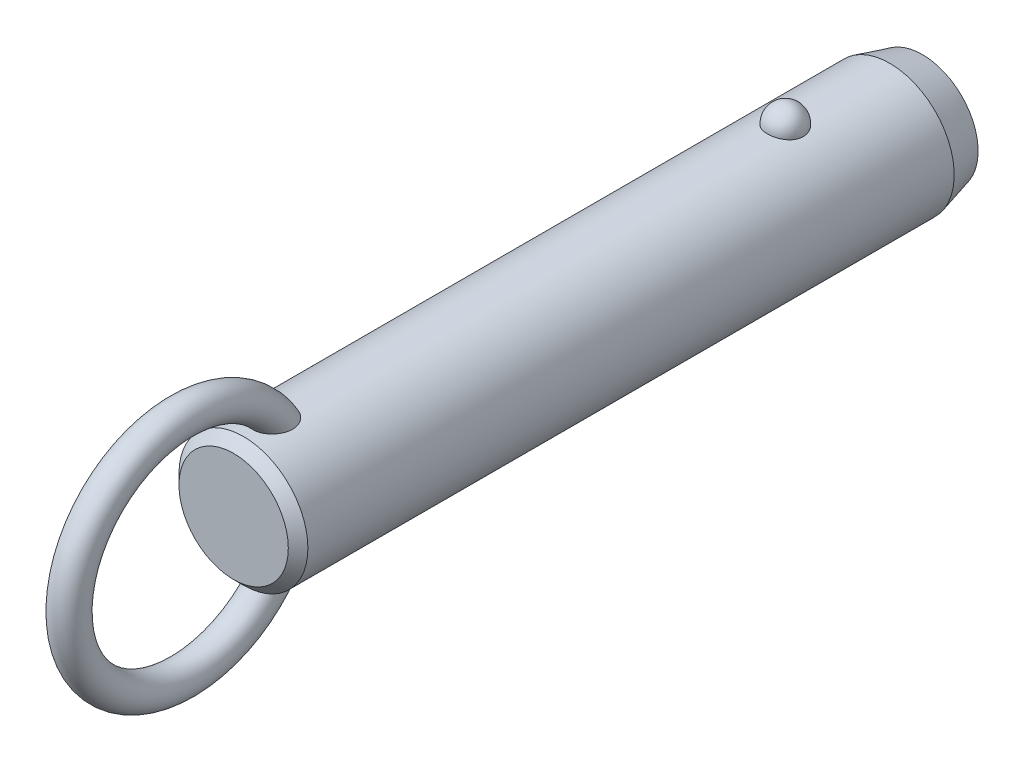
ISO-10303-21;
HEADER;
FILE_DESCRIPTION(('STEP AP214'),'2;1');
FILE_NAME('part.step','',(''),(''),'','','');
FILE_SCHEMA(('AUTOMOTIVE_DESIGN { 1 0 10303 214 1 1 1 1 }'));
ENDSEC;
DATA;
#1=APPLICATION_CONTEXT('core data for automotive mechanical design processes');
#2=APPLICATION_PROTOCOL_DEFINITION('international standard','automotive_design',2000,#1);
#3=PRODUCT_CONTEXT('',#1,'mechanical');
#4=PRODUCT('Part','Part','',(#3));
#5=PRODUCT_RELATED_PRODUCT_CATEGORY('part','',(#4));
#6=PRODUCT_DEFINITION_FORMATION('','',#4);
#7=PRODUCT_DEFINITION_CONTEXT('part definition',#1,'design');
#8=PRODUCT_DEFINITION('design','',#6,#7);
#9=PRODUCT_DEFINITION_SHAPE('','',#8);
#10=(LENGTH_UNIT() NAMED_UNIT(*) SI_UNIT(.MILLI.,.METRE.));
#11=(NAMED_UNIT(*) PLANE_ANGLE_UNIT() SI_UNIT($,.RADIAN.));
#12=(NAMED_UNIT(*) SI_UNIT($,.STERADIAN.) SOLID_ANGLE_UNIT());
#13=UNCERTAINTY_MEASURE_WITH_UNIT(LENGTH_MEASURE(1.E-05),#10,'distance_accuracy_value','');
#14=(GEOMETRIC_REPRESENTATION_CONTEXT(3) GLOBAL_UNCERTAINTY_ASSIGNED_CONTEXT((#13)) GLOBAL_UNIT_ASSIGNED_CONTEXT((#10,
#11,#12)) REPRESENTATION_CONTEXT('',''));
#15=CARTESIAN_POINT('',(0.,0.,0.));
#16=DIRECTION('',(0.,0.,1.));
#17=DIRECTION('',(1.,0.,0.));
#18=AXIS2_PLACEMENT_3D('',#15,#16,#17);
#19=CARTESIAN_POINT('',(0.,0.,55.9));
#20=DIRECTION('',(0.,0.,-1.));
#21=DIRECTION('',(-1.,0.,0.));
#22=AXIS2_PLACEMENT_3D('',#19,#20,#21);
#23=CYLINDRICAL_SURFACE('',#22,7.9);
#24=CARTESIAN_POINT('',(2.1785689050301,7.59367088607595,-2.2));
#25=CARTESIAN_POINT('',(2.17856679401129,7.59367269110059,-2.07701843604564));
#26=CARTESIAN_POINT('',(2.16853481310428,7.59657145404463,-1.95401006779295));
#27=CARTESIAN_POINT('',(2.12864689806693,7.607843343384,-1.71147811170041));
#28=CARTESIAN_POINT('',(2.09878338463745,7.61621856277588,-1.59195587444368));
#29=CARTESIAN_POINT('',(2.0199931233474,7.63749180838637,-1.35985638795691));
#30=CARTESIAN_POINT('',(1.97107475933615,7.6503878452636,-1.24727610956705));
#31=CARTESIAN_POINT('',(1.85539377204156,7.67926115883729,-1.03213234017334));
#32=CARTESIAN_POINT('',(1.78863158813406,7.69523835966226,-0.9295686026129));
#33=CARTESIAN_POINT('',(1.63856494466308,7.7285848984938,-0.736786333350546));
#34=CARTESIAN_POINT('',(1.55518140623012,7.7459606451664,-0.646630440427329));
#35=CARTESIAN_POINT('',(1.37422937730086,7.78009978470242,-0.481747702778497));
#36=CARTESIAN_POINT('',(1.27666086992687,7.79686317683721,-0.4070208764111));
#37=CARTESIAN_POINT('',(1.07024728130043,7.82786153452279,-0.275278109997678));
#38=CARTESIAN_POINT('',(0.961434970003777,7.84210353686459,-0.218212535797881));
#39=CARTESIAN_POINT('',(0.735351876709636,7.86652194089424,-0.123146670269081));
#40=CARTESIAN_POINT('',(0.618082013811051,7.87669878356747,-0.0851443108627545));
#41=CARTESIAN_POINT('',(0.380637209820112,7.89170521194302,-0.0298158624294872));
#42=CARTESIAN_POINT('',(0.260550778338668,7.89662650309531,-0.0121347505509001));
#43=CARTESIAN_POINT('',(0.0190117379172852,7.90090003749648,0.00324379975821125));
#44=CARTESIAN_POINT('',(-0.102440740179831,7.90025280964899,0.000943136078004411));
#45=CARTESIAN_POINT('',(-0.341452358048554,7.89351056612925,-0.0233955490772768));
#46=CARTESIAN_POINT('',(-0.459042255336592,7.88749257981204,-0.0451545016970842));
#47=CARTESIAN_POINT('',(-0.688796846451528,7.87075812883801,-0.107408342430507));
#48=CARTESIAN_POINT('',(-0.800961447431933,7.86004158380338,-0.147903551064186));
#49=CARTESIAN_POINT('',(-1.01743634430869,7.83497131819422,-0.246799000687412));
#50=CARTESIAN_POINT('',(-1.12169791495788,7.82059709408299,-0.305300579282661));
#51=CARTESIAN_POINT('',(-1.31891765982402,7.78976470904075,-0.438549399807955));
#52=CARTESIAN_POINT('',(-1.41187469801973,7.77330633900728,-0.513298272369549));
#53=CARTESIAN_POINT('',(-1.58577142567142,7.73972434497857,-0.678622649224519));
#54=CARTESIAN_POINT('',(-1.66645140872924,7.72259402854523,-0.769470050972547));
#55=CARTESIAN_POINT('',(-1.81161503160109,7.68983776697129,-0.963538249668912));
#56=CARTESIAN_POINT('',(-1.87609753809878,7.6742119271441,-1.06675991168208));
#57=CARTESIAN_POINT('',(-1.98790138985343,7.6460202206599,-1.28401170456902));
#58=CARTESIAN_POINT('',(-2.03501994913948,7.63349104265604,-1.39815107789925));
#59=CARTESIAN_POINT('',(-2.10986724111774,7.6131449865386,-1.63301784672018));
#60=CARTESIAN_POINT('',(-2.1375965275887,7.60532797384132,-1.75374505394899));
#61=CARTESIAN_POINT('',(-2.17289256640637,7.5953195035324,-1.99782562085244));
#62=CARTESIAN_POINT('',(-2.18054294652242,7.59310471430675,-2.12116592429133));
#63=CARTESIAN_POINT('',(-2.17572919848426,7.59448538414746,-2.36741799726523));
#64=CARTESIAN_POINT('',(-2.1632656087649,7.59808068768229,-2.49032977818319));
#65=CARTESIAN_POINT('',(-2.11865035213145,7.61064035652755,-2.73161015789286));
#66=CARTESIAN_POINT('',(-2.08659579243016,7.61957823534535,-2.84999812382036));
#67=CARTESIAN_POINT('',(-2.00367799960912,7.64179982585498,-3.07955956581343));
#68=CARTESIAN_POINT('',(-1.9528140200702,7.65508371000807,-3.19073275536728));
#69=CARTESIAN_POINT('',(-1.83321113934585,7.68460381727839,-3.40337899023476));
#70=CARTESIAN_POINT('',(-1.76437735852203,7.70085556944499,-3.50479651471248));
#71=CARTESIAN_POINT('',(-1.61069526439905,7.73445734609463,-3.69446912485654));
#72=CARTESIAN_POINT('',(-1.52584634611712,7.75180741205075,-3.78272371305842));
#73=CARTESIAN_POINT('',(-1.34198059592,7.78574608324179,-3.94393987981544));
#74=CARTESIAN_POINT('',(-1.24291308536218,7.80233167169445,-4.01684434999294));
#75=CARTESIAN_POINT('',(-1.03352039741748,7.83281625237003,-4.14489386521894));
#76=CARTESIAN_POINT('',(-0.92319600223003,7.84671543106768,-4.20004014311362));
#77=CARTESIAN_POINT('',(-0.695822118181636,7.87011575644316,-4.29042017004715));
#78=CARTESIAN_POINT('',(-0.578872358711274,7.87966903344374,-4.32589112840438));
#79=CARTESIAN_POINT('',(-0.340410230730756,7.8935652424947,-4.37692226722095));
#80=CARTESIAN_POINT('',(-0.218898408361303,7.89790879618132,-4.39248482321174));
#81=CARTESIAN_POINT('',(0.0228107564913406,7.90087453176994,-4.40314405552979));
#82=CARTESIAN_POINT('',(0.142990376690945,7.89960185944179,-4.39861683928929));
#83=CARTESIAN_POINT('',(0.380829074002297,7.89171262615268,-4.37008293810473));
#84=CARTESIAN_POINT('',(0.498488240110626,7.8850962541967,-4.34607694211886));
#85=CARTESIAN_POINT('',(0.727535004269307,7.86726442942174,-4.27939317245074));
#86=CARTESIAN_POINT('',(0.838944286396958,7.85606616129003,-4.23678512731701));
#87=CARTESIAN_POINT('',(1.05295421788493,7.83025654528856,-4.13408348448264));
#88=CARTESIAN_POINT('',(1.15555431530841,7.81564498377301,-4.07398879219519));
#89=CARTESIAN_POINT('',(1.35076763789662,7.7843022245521,-3.93687432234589));
#90=CARTESIAN_POINT('',(1.4432046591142,7.76754209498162,-3.85961036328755));
#91=CARTESIAN_POINT('',(1.6139111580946,7.73387857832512,-3.69076949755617));
#92=CARTESIAN_POINT('',(1.6921781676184,7.71697516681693,-3.59919010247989));
#93=CARTESIAN_POINT('',(1.83380875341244,7.6845643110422,-3.40247278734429));
#94=CARTESIAN_POINT('',(1.89689280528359,7.66908588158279,-3.29712873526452));
#95=CARTESIAN_POINT('',(2.0047823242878,7.64159441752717,-3.07707931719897));
#96=CARTESIAN_POINT('',(2.0495945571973,7.62958010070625,-2.96237743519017));
#97=CARTESIAN_POINT('',(2.11580183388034,7.61146617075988,-2.74040519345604));
#98=CARTESIAN_POINT('',(2.13929812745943,7.60484503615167,-2.63379846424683));
#99=CARTESIAN_POINT('',(2.17068242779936,7.59594664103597,-2.41813481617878));
#100=CARTESIAN_POINT('',(2.17857077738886,7.59366928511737,-2.30907795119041));
#101=CARTESIAN_POINT('',(2.1785689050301,7.59367088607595,-2.2));
#102=B_SPLINE_CURVE_WITH_KNOTS('',3,(#24,#25,#26,#27,#28,#29,#30,#31,#32,#33,#34,#35,#36,#37,
#38,#39,#40,#41,#42,#43,#44,#45,#46,#47,#48,#49,#50,#51,#52,#53,#54,#55,#56,#57,#58,#59,#60,#61,
#62,#63,#64,#65,#66,#67,#68,#69,#70,#71,#72,#73,#74,#75,#76,#77,#78,#79,#80,#81,#82,#83,#84,#85,
#86,#87,#88,#89,#90,#91,#92,#93,#94,#95,#96,#97,#98,#99,#100,#101),.UNSPECIFIED.,.T.,.F.,(4,2,2,
2,2,2,2,2,2,2,2,2,2,2,2,2,2,2,2,2,2,2,2,2,2,2,2,2,2,2,2,2,2,2,2,2,2,2,4),(0.,0.368552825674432,
0.737246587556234,1.10577831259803,1.4743009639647,1.8446206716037,2.21494081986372,
2.5842105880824,2.95344028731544,3.31611630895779,3.67875788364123,4.03628044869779,
4.39380913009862,4.75338791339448,5.11300280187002,5.47939989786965,5.8458226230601,
6.21639834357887,6.58696347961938,6.95598276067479,7.32499216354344,7.69218715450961,
8.0593967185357,8.42858578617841,8.79778880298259,9.16834203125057,9.5388695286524,
9.90482699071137,10.2707407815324,10.6298333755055,10.9889132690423,11.3466585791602,
11.7044262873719,12.0676511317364,12.4309391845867,12.8004764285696,13.1698767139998,
13.4967701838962,13.8236564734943),.UNSPECIFIED.);
#103=CARTESIAN_POINT('',(2.1785689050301,7.59367088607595,-2.2));
#104=VERTEX_POINT('',#103);
#105=EDGE_CURVE('E41',#104,#104,#102,.T.);
#106=ORIENTED_EDGE('',*,*,#105,.T.);
#107=EDGE_LOOP('',(#106));
#108=FACE_BOUND('',#107,.T.);
#109=CARTESIAN_POINT('',(0.,0.,64.22));
#110=DIRECTION('',(0.,0.,1.));
#111=DIRECTION('',(1.,0.,0.));
#112=AXIS2_PLACEMENT_3D('',#109,#110,#111);
#113=CIRCLE('',#112,7.9);
#114=CARTESIAN_POINT('',(7.9,0.,64.22));
#115=VERTEX_POINT('',#114);
#116=EDGE_CURVE('E10',#115,#115,#113,.F.);
#117=ORIENTED_EDGE('',*,*,#116,.T.);
#118=EDGE_LOOP('',(#117));
#119=FACE_BOUND('',#118,.T.);
#120=CARTESIAN_POINT('',(-0.63096985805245,-7.87476203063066,58.1124322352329));
#121=CARTESIAN_POINT('',(-0.734180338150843,-7.86648998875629,58.147285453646));
#122=CARTESIAN_POINT('',(-0.834476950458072,-7.85639291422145,58.1908160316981));
#123=CARTESIAN_POINT('',(-1.0262035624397,-7.83366343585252,58.294094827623));
#124=CARTESIAN_POINT('',(-1.1176141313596,-7.82102565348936,58.3538775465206));
#125=CARTESIAN_POINT('',(-1.28877277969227,-7.79464922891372,58.4878390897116));
#126=CARTESIAN_POINT('',(-1.36854014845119,-7.78091246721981,58.561993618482));
#127=CARTESIAN_POINT('',(-1.51461521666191,-7.75380398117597,58.7224941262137));
#128=CARTESIAN_POINT('',(-1.58092966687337,-7.74043207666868,58.8088339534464));
#129=CARTESIAN_POINT('',(-1.70019064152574,-7.71512522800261,58.9929784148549));
#130=CARTESIAN_POINT('',(-1.75284037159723,-7.70322473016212,59.0909792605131));
#131=CARTESIAN_POINT('',(-1.84263464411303,-7.68224112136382,59.2941029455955));
#132=CARTESIAN_POINT('',(-1.87977299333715,-7.6731591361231,59.3992286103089));
#133=CARTESIAN_POINT('',(-1.94152728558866,-7.65777930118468,59.6232849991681));
#134=CARTESIAN_POINT('',(-1.96475471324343,-7.65179654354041,59.7426167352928));
#135=CARTESIAN_POINT('',(-1.99449499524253,-7.64409642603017,59.9834298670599));
#136=CARTESIAN_POINT('',(-2.0010005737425,-7.64238092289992,60.1049121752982));
#137=CARTESIAN_POINT('',(-1.99856014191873,-7.64302120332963,60.3683409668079));
#138=CARTESIAN_POINT('',(-1.98680021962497,-7.64611845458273,60.5102565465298));
#139=CARTESIAN_POINT('',(-1.94457772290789,-7.65696186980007,60.7911188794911));
#140=CARTESIAN_POINT('',(-1.91409393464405,-7.66471330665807,60.9300620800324));
#141=CARTESIAN_POINT('',(-1.82768670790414,-7.68582947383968,61.231939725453));
#142=CARTESIAN_POINT('',(-1.76772963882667,-7.70003779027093,61.393686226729));
#143=CARTESIAN_POINT('',(-1.65998501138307,-7.72371550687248,61.6276956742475));
#144=CARTESIAN_POINT('',(-1.621079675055,-7.73200670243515,61.7042974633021));
#145=CARTESIAN_POINT('',(-1.53727726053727,-7.74910377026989,61.8540798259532));
#146=CARTESIAN_POINT('',(-1.49238215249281,-7.75790947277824,61.9272615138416));
#147=CARTESIAN_POINT('',(-1.37397050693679,-7.77993338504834,62.1028838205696));
#148=CARTESIAN_POINT('',(-1.29690364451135,-7.79328473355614,62.2029557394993));
#149=CARTESIAN_POINT('',(-1.12885487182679,-7.81939266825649,62.3907147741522));
#150=CARTESIAN_POINT('',(-1.03789926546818,-7.83215032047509,62.4784247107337));
#151=CARTESIAN_POINT('',(-0.869532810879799,-7.85231710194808,62.6134148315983));
#152=CARTESIAN_POINT('',(-0.795716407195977,-7.86021093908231,62.665076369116));
#153=CARTESIAN_POINT('',(-0.640813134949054,-7.87434920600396,62.7563815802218));
#154=CARTESIAN_POINT('',(-0.559737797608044,-7.88059619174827,62.7960438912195));
#155=CARTESIAN_POINT('',(-0.406456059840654,-7.88984116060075,62.8543008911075));
#156=CARTESIAN_POINT('',(-0.335227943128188,-7.89321892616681,62.8753848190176));
#157=CARTESIAN_POINT('',(-0.190193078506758,-7.89804235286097,62.9054141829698));
#158=CARTESIAN_POINT('',(-0.116388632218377,-7.89948969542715,62.9143701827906));
#159=CARTESIAN_POINT('',(0.031841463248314,-7.90028409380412,62.9192915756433));
#160=CARTESIAN_POINT('',(0.10626813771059,-7.89962640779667,62.9152276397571));
#161=CARTESIAN_POINT('',(0.253290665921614,-7.8962818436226,62.8944615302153));
#162=CARTESIAN_POINT('',(0.325885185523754,-7.8935935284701,62.8777504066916));
#163=CARTESIAN_POINT('',(0.481441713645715,-7.88577340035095,62.8287380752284));
#164=CARTESIAN_POINT('',(0.563611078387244,-7.88026321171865,62.794005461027));
#165=CARTESIAN_POINT('',(0.72112962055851,-7.86741729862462,62.7117965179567));
#166=CARTESIAN_POINT('',(0.796466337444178,-7.86007832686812,62.6642975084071));
#167=CARTESIAN_POINT('',(0.971456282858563,-7.84073285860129,62.536513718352));
#168=CARTESIAN_POINT('',(1.0671968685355,-7.82809461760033,62.4510047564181));
#169=CARTESIAN_POINT('',(1.24418921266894,-7.80192439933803,62.2662327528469));
#170=CARTESIAN_POINT('',(1.32540832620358,-7.78839049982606,62.1669395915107));
#171=CARTESIAN_POINT('',(1.45199971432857,-7.76559693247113,61.9895760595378));
#172=CARTESIAN_POINT('',(1.5008564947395,-7.75626094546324,61.9139542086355));
#173=CARTESIAN_POINT('',(1.59197749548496,-7.7380727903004,61.7587428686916));
#174=CARTESIAN_POINT('',(1.63423919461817,-7.72922080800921,61.6791518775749));
#175=CARTESIAN_POINT('',(1.71222612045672,-7.71231959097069,61.5166640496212));
#176=CARTESIAN_POINT('',(1.74794516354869,-7.70427111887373,61.433764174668));
#177=CARTESIAN_POINT('',(1.81270113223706,-7.68929240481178,61.2652967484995));
#178=CARTESIAN_POINT('',(1.84173789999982,-7.68236218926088,61.1797291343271));
#179=CARTESIAN_POINT('',(1.89322698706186,-7.6698375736,61.0052870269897));
#180=CARTESIAN_POINT('',(1.91558744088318,-7.66426199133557,60.9163838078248));
#181=CARTESIAN_POINT('',(1.95281367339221,-7.65485915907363,60.7369696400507));
#182=CARTESIAN_POINT('',(1.96767946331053,-7.65103190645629,60.6464586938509));
#183=CARTESIAN_POINT('',(2.00021456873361,-7.64262981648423,60.3737320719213));
#184=CARTESIAN_POINT('',(2.00600691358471,-7.6410871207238,60.1897099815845));
#185=CARTESIAN_POINT('',(1.98445334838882,-7.64669564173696,59.8765019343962));
#186=CARTESIAN_POINT('',(1.96607186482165,-7.65149688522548,59.746618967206));
#187=CARTESIAN_POINT('',(1.90884967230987,-7.6659762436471,59.4916321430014));
#188=CARTESIAN_POINT('',(1.87002101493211,-7.67565148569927,59.366525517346));
#189=CARTESIAN_POINT('',(1.77063986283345,-7.69918471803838,59.1245401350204));
#190=CARTESIAN_POINT('',(1.7099372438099,-7.71307150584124,59.0077250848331));
#191=CARTESIAN_POINT('',(1.56733070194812,-7.74330306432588,58.7881444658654));
#192=CARTESIAN_POINT('',(1.48543692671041,-7.75964665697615,58.6853722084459));
#193=CARTESIAN_POINT('',(1.31346177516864,-7.79047523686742,58.5093800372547));
#194=CARTESIAN_POINT('',(1.22547278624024,-7.80495298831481,58.4341066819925));
#195=CARTESIAN_POINT('',(1.03724352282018,-7.83218597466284,58.3004864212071));
#196=CARTESIAN_POINT('',(0.937008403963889,-7.84494192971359,58.2421324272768));
#197=CARTESIAN_POINT('',(0.73359933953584,-7.86649045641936,58.1470270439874));
#198=CARTESIAN_POINT('',(0.630941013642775,-7.87547134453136,58.1092109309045));
#199=CARTESIAN_POINT('',(0.420465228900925,-7.88950708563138,58.0511160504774));
#200=CARTESIAN_POINT('',(0.312645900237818,-7.89456050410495,58.0308436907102));
#201=CARTESIAN_POINT('',(0.0960869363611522,-7.9001518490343,58.0084559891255));
#202=CARTESIAN_POINT('',(-0.0126341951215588,-7.90073226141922,58.0061698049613));
#203=CARTESIAN_POINT('',(-0.228766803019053,-7.89742350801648,58.0193678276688));
#204=CARTESIAN_POINT('',(-0.336180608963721,-7.89354403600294,58.0348134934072));
#205=CARTESIAN_POINT('',(-0.473410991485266,-7.88586871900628,58.0662177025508));
#206=CARTESIAN_POINT('',(-0.505257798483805,-7.88388984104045,58.0743541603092));
#207=CARTESIAN_POINT('',(-0.5684812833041,-7.87958326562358,58.0922083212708));
#208=CARTESIAN_POINT('',(-0.599857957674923,-7.87725556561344,58.1019260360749));
#209=CARTESIAN_POINT('',(-0.63096985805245,-7.87476203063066,58.1124322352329));
#210=B_SPLINE_CURVE_WITH_KNOTS('',3,(#120,#121,#122,#123,#124,#125,#126,#127,#128,#129,#130,
#131,#132,#133,#134,#135,#136,#137,#138,#139,#140,#141,#142,#143,#144,#145,#146,#147,#148,#149,
#150,#151,#152,#153,#154,#155,#156,#157,#158,#159,#160,#161,#162,#163,#164,#165,#166,#167,#168,
#169,#170,#171,#172,#173,#174,#175,#176,#177,#178,#179,#180,#181,#182,#183,#184,#185,#186,#187,
#188,#189,#190,#191,#192,#193,#194,#195,#196,#197,#198,#199,#200,#201,#202,#203,#204,#205,#206,
#207,#208,#209),.UNSPECIFIED.,.T.,.F.,(4,2,2,2,2,2,2,2,2,2,2,2,2,2,2,2,2,2,2,2,2,2,2,2,2,2,2,2,
2,2,2,2,2,2,2,2,2,2,2,2,2,2,2,2,4),(0.,0.327622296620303,0.655945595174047,0.983718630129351,
1.3113267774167,1.64554655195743,1.9798996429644,2.34365728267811,2.70757317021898,
3.13333684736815,3.55958380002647,4.07655306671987,4.33527897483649,4.59391999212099,
4.9738243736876,5.35301797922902,5.62348245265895,5.89352465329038,6.11565959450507,
6.3376009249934,6.56004255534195,6.782641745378,7.04930844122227,7.31645206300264,
7.70130871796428,8.08701995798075,8.35824509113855,8.62957365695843,8.90115735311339,
9.1727474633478,9.44791855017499,9.72308922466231,10.2715298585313,10.6638393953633,
11.0559179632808,11.4507403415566,11.8453740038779,12.1936425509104,12.5417649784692,
12.8695063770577,13.1973674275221,13.5221104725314,13.8461490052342,13.9449071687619,
14.0436660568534),.UNSPECIFIED.);
#211=CARTESIAN_POINT('',(-0.63096985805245,-7.87476203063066,58.1124322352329));
#212=VERTEX_POINT('',#211);
#213=EDGE_CURVE('E60',#212,#212,#210,.T.);
#214=ORIENTED_EDGE('',*,*,#213,.T.);
#215=EDGE_LOOP('',(#214));
#216=FACE_BOUND('',#215,.T.);
#217=CARTESIAN_POINT('',(-0.63096985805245,7.87476203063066,58.1124322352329));
#218=CARTESIAN_POINT('',(-0.528918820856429,7.88293636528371,58.0779798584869));
#219=CARTESIAN_POINT('',(-0.423745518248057,7.88934810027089,58.051915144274));
#220=CARTESIAN_POINT('',(-0.210236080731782,7.8979273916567,58.0172825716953));
#221=CARTESIAN_POINT('',(-0.101893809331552,7.90008607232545,58.0087513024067));
#222=CARTESIAN_POINT('',(0.114660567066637,7.89990877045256,58.0094570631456));
#223=CARTESIAN_POINT('',(0.222872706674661,7.89757640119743,58.0186798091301));
#224=CARTESIAN_POINT('',(0.436107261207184,7.88867538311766,58.0546525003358));
#225=CARTESIAN_POINT('',(0.54113114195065,7.8821087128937,58.0813942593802));
#226=CARTESIAN_POINT('',(0.745085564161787,7.86545130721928,58.1517561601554));
#227=CARTESIAN_POINT('',(0.844015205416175,7.85536005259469,58.1953787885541));
#228=CARTESIAN_POINT('',(1.03299167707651,7.83275153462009,58.2983796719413));
#229=CARTESIAN_POINT('',(1.12303841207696,7.8202342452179,58.3577580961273));
#230=CARTESIAN_POINT('',(1.29214734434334,7.79408219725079,58.4908647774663));
#231=CARTESIAN_POINT('',(1.37116907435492,7.78044359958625,58.5646436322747));
#232=CARTESIAN_POINT('',(1.51597677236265,7.75353170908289,58.7242353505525));
#233=CARTESIAN_POINT('',(1.58176261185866,7.74025841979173,58.8100483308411));
#234=CARTESIAN_POINT('',(1.70057386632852,7.71504069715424,58.993644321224));
#235=CARTESIAN_POINT('',(1.75320073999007,7.7031425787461,59.0916906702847));
#236=CARTESIAN_POINT('',(1.8429376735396,7.68216822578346,59.2948931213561));
#237=CARTESIAN_POINT('',(1.88004278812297,7.67309289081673,59.4000514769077));
#238=CARTESIAN_POINT('',(1.94172327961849,7.6577294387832,59.6241671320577));
#239=CARTESIAN_POINT('',(1.96491037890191,7.65175648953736,59.7435248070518));
#240=CARTESIAN_POINT('',(1.9945689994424,7.64407702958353,59.9843848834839));
#241=CARTESIAN_POINT('',(2.00103304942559,7.64237242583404,60.1058882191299));
#242=CARTESIAN_POINT('',(1.99850166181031,7.64303650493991,60.3693688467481));
#243=CARTESIAN_POINT('',(1.98669038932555,7.64614714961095,60.5113141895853));
#244=CARTESIAN_POINT('',(1.94436120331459,7.65701701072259,60.7922287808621));
#245=CARTESIAN_POINT('',(1.91382203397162,7.66478150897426,60.9311944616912));
#246=CARTESIAN_POINT('',(1.82728754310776,7.68592483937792,61.2331110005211));
#247=CARTESIAN_POINT('',(1.76725778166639,7.7001468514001,61.3948721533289));
#248=CARTESIAN_POINT('',(1.65939700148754,7.72384204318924,61.6288914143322));
#249=CARTESIAN_POINT('',(1.62045187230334,7.73213852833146,61.7054942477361));
#250=CARTESIAN_POINT('',(1.53656684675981,7.74924489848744,61.8552737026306));
#251=CARTESIAN_POINT('',(1.49162892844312,7.75805461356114,61.9284514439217));
#252=CARTESIAN_POINT('',(1.37317698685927,7.78007342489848,62.1039520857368));
#253=CARTESIAN_POINT('',(1.29612360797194,7.79341423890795,62.2039112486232));
#254=CARTESIAN_POINT('',(1.12812043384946,7.81949839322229,62.3914508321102));
#255=CARTESIAN_POINT('',(1.03719688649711,7.83224280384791,62.4790540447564));
#256=CARTESIAN_POINT('',(0.86887194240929,7.85239026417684,62.6138971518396));
#257=CARTESIAN_POINT('',(0.795056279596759,7.86027769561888,62.6655113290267));
#258=CARTESIAN_POINT('',(0.640160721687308,7.87440222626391,62.7567201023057));
#259=CARTESIAN_POINT('',(0.559092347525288,7.88064188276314,62.7963333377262));
#260=CARTESIAN_POINT('',(0.40582092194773,7.8898738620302,62.8545056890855));
#261=CARTESIAN_POINT('',(0.334594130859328,7.89324577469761,62.8755523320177));
#262=CARTESIAN_POINT('',(0.189568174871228,7.89805733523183,62.9055070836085));
#263=CARTESIAN_POINT('',(0.115771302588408,7.89949866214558,62.9144257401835));
#264=CARTESIAN_POINT('',(-0.0324359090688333,7.90028156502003,62.9192758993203));
#265=CARTESIAN_POINT('',(-0.106847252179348,7.89961843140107,62.9151782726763));
#266=CARTESIAN_POINT('',(-0.253834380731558,7.8962642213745,62.8943519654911));
#267=CARTESIAN_POINT('',(-0.326408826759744,7.89357170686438,62.8776143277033));
#268=CARTESIAN_POINT('',(-0.481962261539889,7.88574179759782,62.8285391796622));
#269=CARTESIAN_POINT('',(-0.564145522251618,7.88022507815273,62.7937638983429));
#270=CARTESIAN_POINT('',(-0.72168526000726,7.8673664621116,62.7114686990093));
#271=CARTESIAN_POINT('',(-0.797029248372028,7.8600213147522,62.6639260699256));
#272=CARTESIAN_POINT('',(-0.972044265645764,7.84066026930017,62.5360267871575));
#273=CARTESIAN_POINT('',(-1.06779803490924,7.82801274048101,62.4504436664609));
#274=CARTESIAN_POINT('',(-1.24480531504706,7.80182621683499,62.2655223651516));
#275=CARTESIAN_POINT('',(-1.32602618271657,7.78828530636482,62.1661540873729));
#276=CARTESIAN_POINT('',(-1.45259834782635,7.76548487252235,61.9886806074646));
#277=CARTESIAN_POINT('',(-1.50143856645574,7.75614818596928,61.9130252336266));
#278=CARTESIAN_POINT('',(-1.59252410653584,7.7379602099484,61.7577484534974));
#279=CARTESIAN_POINT('',(-1.63476690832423,7.72910910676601,61.6781255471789));
#280=CARTESIAN_POINT('',(-1.71271318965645,7.71221133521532,61.5155750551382));
#281=CARTESIAN_POINT('',(-1.74841047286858,7.70416543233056,61.4326444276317));
#282=CARTESIAN_POINT('',(-1.81311929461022,7.68919371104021,61.2641168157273));
#283=CARTESIAN_POINT('',(-1.84213067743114,7.6822679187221,61.1785197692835));
#284=CARTESIAN_POINT('',(-1.89356259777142,7.66975461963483,61.0040254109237));
#285=CARTESIAN_POINT('',(-1.91589165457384,7.66418586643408,60.9150995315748));
#286=CARTESIAN_POINT('',(-1.95305070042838,7.65479859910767,60.7356424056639));
#287=CARTESIAN_POINT('',(-1.96788069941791,7.65098008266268,60.6451111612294));
#288=CARTESIAN_POINT('',(-2.00030078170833,7.64260704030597,60.3723270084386));
#289=CARTESIAN_POINT('',(-2.00600576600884,7.64108760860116,60.1882718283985));
#290=CARTESIAN_POINT('',(-1.98428483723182,7.64673945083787,59.8750800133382));
#291=CARTESIAN_POINT('',(-1.96583698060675,7.6515575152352,59.7452400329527));
#292=CARTESIAN_POINT('',(-1.90848948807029,7.66606613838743,59.4903619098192));
#293=CARTESIAN_POINT('',(-1.86960376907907,7.67575338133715,59.3653205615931));
#294=CARTESIAN_POINT('',(-1.77013421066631,7.69930132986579,59.1235009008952));
#295=CARTESIAN_POINT('',(-1.7094048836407,7.71318991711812,59.0067844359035));
#296=CARTESIAN_POINT('',(-1.56672953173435,7.74342495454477,58.7873404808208));
#297=CARTESIAN_POINT('',(-1.48478316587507,7.75977144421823,58.6846132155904));
#298=CARTESIAN_POINT('',(-1.312663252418,7.7906116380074,58.5086431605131));
#299=CARTESIAN_POINT('',(-1.22456383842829,7.80509908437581,58.4333589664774));
#300=CARTESIAN_POINT('',(-1.03622400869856,7.83231881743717,58.2998659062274));
#301=CARTESIAN_POINT('',(-0.936015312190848,7.84505551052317,58.2416137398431));
#302=CARTESIAN_POINT('',(-0.798824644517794,7.85957802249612,58.1775408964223));
#303=CARTESIAN_POINT('',(-0.765787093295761,7.8628682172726,58.1632248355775));
#304=CARTESIAN_POINT('',(-0.698939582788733,7.86909211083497,58.136436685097));
#305=CARTESIAN_POINT('',(-0.665129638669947,7.8720258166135,58.1239645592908));
#306=CARTESIAN_POINT('',(-0.63096985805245,7.87476203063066,58.1124322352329));
#307=B_SPLINE_CURVE_WITH_KNOTS('',3,(#217,#218,#219,#220,#221,#222,#223,#224,#225,#226,#227,
#228,#229,#230,#231,#232,#233,#234,#235,#236,#237,#238,#239,#240,#241,#242,#243,#244,#245,#246,
#247,#248,#249,#250,#251,#252,#253,#254,#255,#256,#257,#258,#259,#260,#261,#262,#263,#264,#265,
#266,#267,#268,#269,#270,#271,#272,#273,#274,#275,#276,#277,#278,#279,#280,#281,#282,#283,#284,
#285,#286,#287,#288,#289,#290,#291,#292,#293,#294,#295,#296,#297,#298,#299,#300,#301,#302,#303,
#304,#305,#306),.UNSPECIFIED.,.T.,.F.,(4,2,2,2,2,2,2,2,2,2,2,2,2,2,2,2,2,2,2,2,2,2,2,2,2,2,2,2,
2,2,2,2,2,2,2,2,2,2,2,2,2,2,2,2,4),(0.,0.323920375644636,0.648516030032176,0.972850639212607,
1.29703380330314,1.62126473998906,1.94549915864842,2.27089401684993,2.59629203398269,
2.93059633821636,3.26500707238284,3.62881644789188,3.99278833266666,4.41865421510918,
4.84500434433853,5.36209210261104,5.620875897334,5.87957448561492,6.2591859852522,
6.63808782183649,6.9084674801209,7.17842501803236,7.40052350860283,7.62242871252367,
7.84483086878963,8.06739077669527,8.33414615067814,8.60137921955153,8.98641454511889,
9.37230415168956,9.64358673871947,9.91497268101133,10.1866142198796,10.458262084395,
10.7334745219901,11.0086865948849,11.5572126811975,11.9494246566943,12.3413699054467,
12.7359755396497,13.1305875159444,13.4791770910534,13.82687259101,13.9353013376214,
14.0437279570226),.UNSPECIFIED.);
#308=CARTESIAN_POINT('',(-0.63096985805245,7.87476203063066,58.1124322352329));
#309=VERTEX_POINT('',#308);
#310=EDGE_CURVE('E68',#309,#309,#307,.T.);
#311=ORIENTED_EDGE('',*,*,#310,.T.);
#312=EDGE_LOOP('',(#311));
#313=FACE_BOUND('',#312,.T.);
#314=CARTESIAN_POINT('',(0.,0.,-15.));
#315=DIRECTION('',(0.,0.,-1.));
#316=DIRECTION('',(-1.,0.,0.));
#317=AXIS2_PLACEMENT_3D('',#314,#315,#316);
#318=CIRCLE('',#317,7.9);
#319=CARTESIAN_POINT('',(-7.9,0.,-15.));
#320=VERTEX_POINT('',#319);
#321=EDGE_CURVE('E57',#320,#320,#318,.F.);
#322=ORIENTED_EDGE('',*,*,#321,.T.);
#323=EDGE_LOOP('',(#322));
#324=FACE_BOUND('',#323,.T.);
#325=ADVANCED_FACE('F37',(#108,#119,#216,#313,#324),#23,.T.);
#326=CARTESIAN_POINT('',(0.,0.,-19.));
#327=DIRECTION('',(0.,0.,-1.));
#328=DIRECTION('',(-1.,0.,0.));
#329=AXIS2_PLACEMENT_3D('',#326,#327,#328);
#330=PLANE('',#329);
#331=CARTESIAN_POINT('',(0.,0.,-19.));
#332=DIRECTION('',(0.,0.,-1.));
#333=DIRECTION('',(-1.,0.,0.));
#334=AXIS2_PLACEMENT_3D('',#331,#332,#333);
#335=CIRCLE('',#334,6.82820323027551);
#336=CARTESIAN_POINT('',(-6.82820323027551,0.,-19.));
#337=VERTEX_POINT('',#336);
#338=EDGE_CURVE('E67',#337,#337,#335,.T.);
#339=ORIENTED_EDGE('',*,*,#338,.T.);
#340=EDGE_LOOP('',(#339));
#341=FACE_BOUND('',#340,.T.);
#342=ADVANCED_FACE('F86',(#341),#330,.T.);
#343=CARTESIAN_POINT('',(0.,0.,-19.));
#344=DIRECTION('',(0.,0.,1.));
#345=DIRECTION('',(1.,0.,0.));
#346=AXIS2_PLACEMENT_3D('',#343,#344,#345);
#347=CONICAL_SURFACE('',#346,6.82820323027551,0.261799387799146);
#348=ORIENTED_EDGE('',*,*,#321,.F.);
#349=EDGE_LOOP('',(#348));
#350=FACE_BOUND('',#349,.T.);
#351=ORIENTED_EDGE('',*,*,#338,.F.);
#352=EDGE_LOOP('',(#351));
#353=FACE_BOUND('',#352,.T.);
#354=ADVANCED_FACE('F84',(#350,#353),#347,.T.);
#355=CARTESIAN_POINT('',(0.,0.,65.42));
#356=DIRECTION('',(0.,0.,1.));
#357=DIRECTION('',(1.,0.,0.));
#358=AXIS2_PLACEMENT_3D('',#355,#356,#357);
#359=PLANE('',#358);
#360=CARTESIAN_POINT('',(0.,0.,65.42));
#361=DIRECTION('',(0.,0.,1.));
#362=DIRECTION('',(1.,0.,0.));
#363=AXIS2_PLACEMENT_3D('',#360,#361,#362);
#364=CIRCLE('',#363,6.7);
#365=CARTESIAN_POINT('',(6.7,0.,65.42));
#366=VERTEX_POINT('',#365);
#367=EDGE_CURVE('E50',#366,#366,#364,.T.);
#368=ORIENTED_EDGE('',*,*,#367,.T.);
#369=EDGE_LOOP('',(#368));
#370=FACE_BOUND('',#369,.T.);
#371=ADVANCED_FACE('F78',(#370),#359,.T.);
#372=CARTESIAN_POINT('',(0.,0.,71.75));
#373=DIRECTION('',(1.,0.,0.));
#374=DIRECTION('',(0.,0.,-1.));
#375=AXIS2_PLACEMENT_3D('',#372,#373,#374);
#376=TOROIDAL_SURFACE('',#375,13.85,2.);
#377=ORIENTED_EDGE('',*,*,#310,.F.);
#378=EDGE_LOOP('',(#377));
#379=FACE_BOUND('',#378,.T.);
#380=ORIENTED_EDGE('',*,*,#213,.F.);
#381=EDGE_LOOP('',(#380));
#382=FACE_BOUND('',#381,.T.);
#383=ADVANCED_FACE('F74',(#379,#382),#376,.T.);
#384=CARTESIAN_POINT('',(0.,0.,65.42));
#385=DIRECTION('',(0.,0.,-1.));
#386=DIRECTION('',(-1.,0.,0.));
#387=AXIS2_PLACEMENT_3D('',#384,#385,#386);
#388=CONICAL_SURFACE('',#387,6.7,0.785398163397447);
#389=ORIENTED_EDGE('',*,*,#116,.F.);
#390=EDGE_LOOP('',(#389));
#391=FACE_BOUND('',#390,.T.);
#392=ORIENTED_EDGE('',*,*,#367,.F.);
#393=EDGE_LOOP('',(#392));
#394=FACE_BOUND('',#393,.T.);
#395=ADVANCED_FACE('F39',(#391,#394),#388,.T.);
#396=CARTESIAN_POINT('',(0.,7.9,-2.2));
#397=DIRECTION('',(0.,1.,0.));
#398=DIRECTION('',(0.,0.,-1.));
#399=AXIS2_PLACEMENT_3D('',#396,#397,#398);
#400=SPHERICAL_SURFACE('',#399,2.2);
#401=ORIENTED_EDGE('',*,*,#105,.F.);
#402=EDGE_LOOP('',(#401));
#403=FACE_BOUND('',#402,.T.);
#404=ADVANCED_FACE('F80',(#403),#400,.T.);
#405=CLOSED_SHELL('',(#325,#342,#354,#371,#383,#395,#404));
#406=MANIFOLD_SOLID_BREP('B2',#405);
#407=ADVANCED_BREP_SHAPE_REPRESENTATION('',(#18,#406),#14);
#408=SHAPE_DEFINITION_REPRESENTATION(#9,#407);
ENDSEC;
END-ISO-10303-21;
